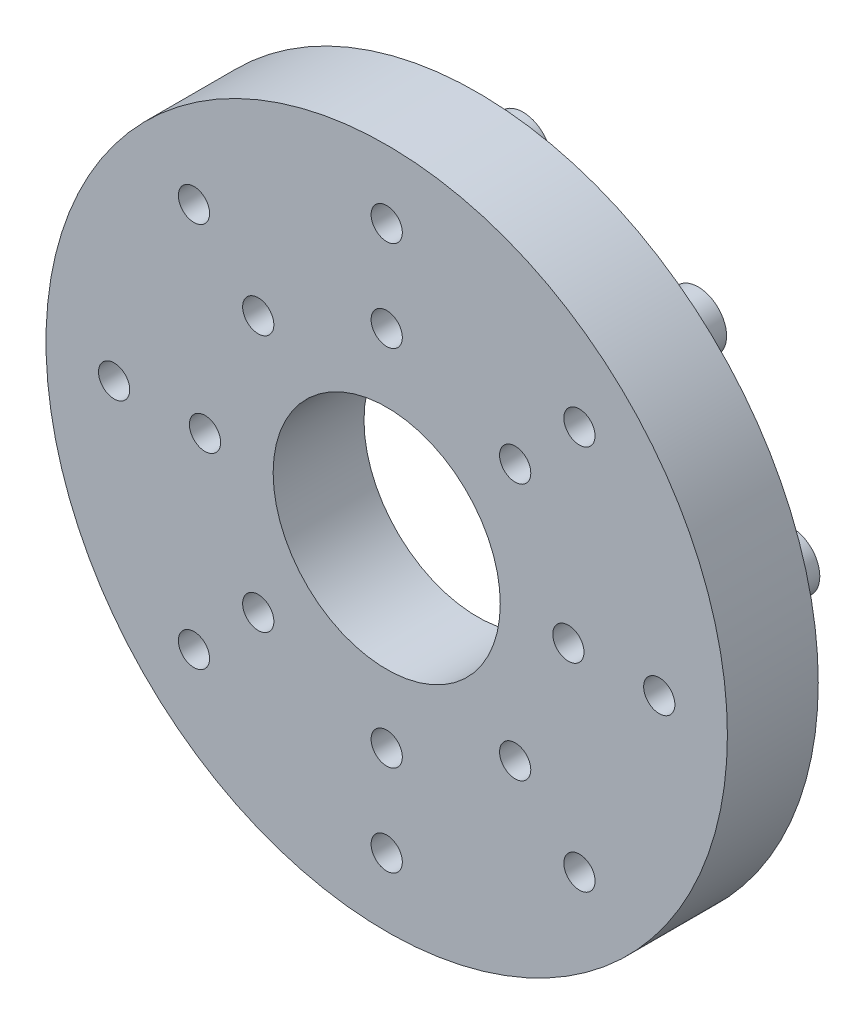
ISO-10303-21;
HEADER;
FILE_DESCRIPTION(('STEP AP214'),'2;1');
FILE_NAME('part.step','',(''),(''),'','','');
FILE_SCHEMA(('AUTOMOTIVE_DESIGN { 1 0 10303 214 1 1 1 1 }'));
ENDSEC;
DATA;
#1=APPLICATION_CONTEXT('core data for automotive mechanical design processes');
#2=APPLICATION_PROTOCOL_DEFINITION('international standard','automotive_design',2000,#1);
#3=PRODUCT_CONTEXT('',#1,'mechanical');
#4=PRODUCT('Part','Part','',(#3));
#5=PRODUCT_RELATED_PRODUCT_CATEGORY('part','',(#4));
#6=PRODUCT_DEFINITION_FORMATION('','',#4);
#7=PRODUCT_DEFINITION_CONTEXT('part definition',#1,'design');
#8=PRODUCT_DEFINITION('design','',#6,#7);
#9=PRODUCT_DEFINITION_SHAPE('','',#8);
#10=(LENGTH_UNIT() NAMED_UNIT(*) SI_UNIT(.MILLI.,.METRE.));
#11=(NAMED_UNIT(*) PLANE_ANGLE_UNIT() SI_UNIT($,.RADIAN.));
#12=(NAMED_UNIT(*) SI_UNIT($,.STERADIAN.) SOLID_ANGLE_UNIT());
#13=UNCERTAINTY_MEASURE_WITH_UNIT(LENGTH_MEASURE(1.E-05),#10,'distance_accuracy_value','');
#14=(GEOMETRIC_REPRESENTATION_CONTEXT(3) GLOBAL_UNCERTAINTY_ASSIGNED_CONTEXT((#13)) GLOBAL_UNIT_ASSIGNED_CONTEXT((#10,
#11,#12)) REPRESENTATION_CONTEXT('',''));
#15=CARTESIAN_POINT('',(0.,0.,0.));
#16=DIRECTION('',(0.,0.,1.));
#17=DIRECTION('',(1.,0.,0.));
#18=AXIS2_PLACEMENT_3D('',#15,#16,#17);
#19=CARTESIAN_POINT('',(0.,0.,-25.4));
#20=DIRECTION('',(0.,0.,1.));
#21=DIRECTION('',(1.,0.,0.));
#22=AXIS2_PLACEMENT_3D('',#19,#20,#21);
#23=PLANE('',#22);
#24=CARTESIAN_POINT('',(150.084701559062,26.4639822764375,-25.4));
#25=DIRECTION('',(0.,0.,1.));
#26=DIRECTION('',(1.,0.,0.));
#27=AXIS2_PLACEMENT_3D('',#24,#25,#26);
#28=CIRCLE('',#27,15.875);
#29=CARTESIAN_POINT('',(165.959701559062,26.4639822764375,-25.4));
#30=VERTEX_POINT('',#29);
#31=EDGE_CURVE('E56',#30,#30,#28,.F.);
#32=ORIENTED_EDGE('',*,*,#31,.F.);
#33=EDGE_LOOP('',(#32));
#34=FACE_BOUND('',#33,.T.);
#35=CARTESIAN_POINT('',(52.1238698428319,-143.209155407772,-25.4));
#36=DIRECTION('',(0.,0.,1.));
#37=DIRECTION('',(1.,0.,0.));
#38=AXIS2_PLACEMENT_3D('',#35,#36,#37);
#39=CIRCLE('',#38,15.875);
#40=CARTESIAN_POINT('',(67.9988698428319,-143.209155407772,-25.4));
#41=VERTEX_POINT('',#40);
#42=EDGE_CURVE('E264',#41,#41,#39,.F.);
#43=ORIENTED_EDGE('',*,*,#42,.F.);
#44=EDGE_LOOP('',(#43));
#45=FACE_BOUND('',#44,.T.);
#46=CARTESIAN_POINT('',(-131.982271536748,-76.2,-25.4));
#47=DIRECTION('',(0.,0.,1.));
#48=DIRECTION('',(1.,0.,0.));
#49=AXIS2_PLACEMENT_3D('',#46,#47,#48);
#50=CIRCLE('',#49,15.875);
#51=CARTESIAN_POINT('',(-116.107271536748,-76.2,-25.4));
#52=VERTEX_POINT('',#51);
#53=EDGE_CURVE('E258',#52,#52,#50,.F.);
#54=ORIENTED_EDGE('',*,*,#53,.F.);
#55=EDGE_LOOP('',(#54));
#56=FACE_BOUND('',#55,.T.);
#57=CARTESIAN_POINT('',(-97.9608317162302,116.745173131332,-25.4));
#58=DIRECTION('',(0.,0.,1.));
#59=DIRECTION('',(1.,0.,0.));
#60=AXIS2_PLACEMENT_3D('',#57,#58,#59);
#61=CIRCLE('',#60,15.875);
#62=CARTESIAN_POINT('',(-82.0858317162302,116.745173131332,-25.4));
#63=VERTEX_POINT('',#62);
#64=EDGE_CURVE('E252',#63,#63,#61,.F.);
#65=ORIENTED_EDGE('',*,*,#64,.F.);
#66=EDGE_LOOP('',(#65));
#67=FACE_BOUND('',#66,.T.);
#68=CARTESIAN_POINT('',(0.,0.,-25.4));
#69=DIRECTION('',(0.,0.,1.));
#70=DIRECTION('',(1.,0.,0.));
#71=AXIS2_PLACEMENT_3D('',#68,#69,#70);
#72=CIRCLE('',#71,63.5);
#73=CARTESIAN_POINT('',(63.5,0.,-25.4));
#74=VERTEX_POINT('',#73);
#75=EDGE_CURVE('E237',#74,#74,#72,.T.);
#76=ORIENTED_EDGE('',*,*,#75,.T.);
#77=EDGE_LOOP('',(#76));
#78=FACE_BOUND('',#77,.T.);
#79=CARTESIAN_POINT('',(0.,0.,-25.4));
#80=DIRECTION('',(0.,0.,1.));
#81=DIRECTION('',(1.,0.,0.));
#82=AXIS2_PLACEMENT_3D('',#79,#80,#81);
#83=CIRCLE('',#82,190.5);
#84=CARTESIAN_POINT('',(190.5,0.,-25.4));
#85=VERTEX_POINT('',#84);
#86=EDGE_CURVE('E241',#85,#85,#83,.T.);
#87=ORIENTED_EDGE('',*,*,#86,.F.);
#88=EDGE_LOOP('',(#87));
#89=FACE_BOUND('',#88,.T.);
#90=CARTESIAN_POINT('',(0.,152.4,-25.4));
#91=DIRECTION('',(0.,0.,1.));
#92=DIRECTION('',(1.,0.,0.));
#93=AXIS2_PLACEMENT_3D('',#90,#91,#92);
#94=CIRCLE('',#93,15.875);
#95=CARTESIAN_POINT('',(15.875,152.4,-25.4));
#96=VERTEX_POINT('',#95);
#97=EDGE_CURVE('E247',#96,#96,#94,.F.);
#98=ORIENTED_EDGE('',*,*,#97,.F.);
#99=EDGE_LOOP('',(#98));
#100=FACE_BOUND('',#99,.T.);
#101=CARTESIAN_POINT('',(-150.084701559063,26.4639822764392,-25.4));
#102=DIRECTION('',(0.,0.,1.));
#103=DIRECTION('',(1.,0.,0.));
#104=AXIS2_PLACEMENT_3D('',#101,#102,#103);
#105=CIRCLE('',#104,15.875);
#106=CARTESIAN_POINT('',(-134.209701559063,26.4639822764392,-25.4));
#107=VERTEX_POINT('',#106);
#108=EDGE_CURVE('E255',#107,#107,#105,.F.);
#109=ORIENTED_EDGE('',*,*,#108,.F.);
#110=EDGE_LOOP('',(#109));
#111=FACE_BOUND('',#110,.T.);
#112=CARTESIAN_POINT('',(-52.1238698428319,-143.209155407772,-25.4));
#113=DIRECTION('',(0.,0.,1.));
#114=DIRECTION('',(1.,0.,0.));
#115=AXIS2_PLACEMENT_3D('',#112,#113,#114);
#116=CIRCLE('',#115,15.875);
#117=CARTESIAN_POINT('',(-36.2488698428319,-143.209155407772,-25.4));
#118=VERTEX_POINT('',#117);
#119=EDGE_CURVE('E261',#118,#118,#116,.F.);
#120=ORIENTED_EDGE('',*,*,#119,.F.);
#121=EDGE_LOOP('',(#120));
#122=FACE_BOUND('',#121,.T.);
#123=CARTESIAN_POINT('',(131.982271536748,-76.2,-25.4));
#124=DIRECTION('',(0.,0.,1.));
#125=DIRECTION('',(1.,0.,0.));
#126=AXIS2_PLACEMENT_3D('',#123,#124,#125);
#127=CIRCLE('',#126,15.875);
#128=CARTESIAN_POINT('',(147.857271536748,-76.2,-25.4));
#129=VERTEX_POINT('',#128);
#130=EDGE_CURVE('E267',#129,#129,#127,.F.);
#131=ORIENTED_EDGE('',*,*,#130,.F.);
#132=EDGE_LOOP('',(#131));
#133=FACE_BOUND('',#132,.T.);
#134=CARTESIAN_POINT('',(97.9608317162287,116.745173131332,-25.4));
#135=DIRECTION('',(0.,0.,1.));
#136=DIRECTION('',(1.,0.,0.));
#137=AXIS2_PLACEMENT_3D('',#134,#135,#136);
#138=CIRCLE('',#137,15.875);
#139=CARTESIAN_POINT('',(113.835831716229,116.745173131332,-25.4));
#140=VERTEX_POINT('',#139);
#141=EDGE_CURVE('E13',#140,#140,#138,.F.);
#142=ORIENTED_EDGE('',*,*,#141,.F.);
#143=EDGE_LOOP('',(#142));
#144=FACE_BOUND('',#143,.T.);
#145=ADVANCED_FACE('F48',(#34,#45,#56,#67,#78,#89,#100,#111,#122,#133,#144),#23,.F.);
#146=CARTESIAN_POINT('',(0.,0.,25.4));
#147=DIRECTION('',(0.,0.,1.));
#148=DIRECTION('',(1.,0.,0.));
#149=AXIS2_PLACEMENT_3D('',#146,#147,#148);
#150=PLANE('',#149);
#151=CARTESIAN_POINT('',(0.,101.5873,25.4));
#152=DIRECTION('',(0.,0.,1.));
#153=DIRECTION('',(1.,0.,0.));
#154=AXIS2_PLACEMENT_3D('',#151,#152,#153);
#155=CIRCLE('',#154,8.73124999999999);
#156=CARTESIAN_POINT('',(8.73124999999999,101.5873,25.4));
#157=VERTEX_POINT('',#156);
#158=EDGE_CURVE('E116',#157,#157,#155,.T.);
#159=ORIENTED_EDGE('',*,*,#158,.F.);
#160=EDGE_LOOP('',(#159));
#161=FACE_BOUND('',#160,.T.);
#162=CARTESIAN_POINT('',(0.,152.4,25.4));
#163=DIRECTION('',(0.,0.,1.));
#164=DIRECTION('',(1.,0.,0.));
#165=AXIS2_PLACEMENT_3D('',#162,#163,#164);
#166=CIRCLE('',#165,8.73124999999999);
#167=CARTESIAN_POINT('',(8.73124999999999,152.4,25.4));
#168=VERTEX_POINT('',#167);
#169=EDGE_CURVE('E115',#168,#168,#166,.T.);
#170=ORIENTED_EDGE('',*,*,#169,.F.);
#171=EDGE_LOOP('',(#170));
#172=FACE_BOUND('',#171,.T.);
#173=CARTESIAN_POINT('',(107.763073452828,107.763073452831,25.4));
#174=DIRECTION('',(0.,0.,1.));
#175=DIRECTION('',(1.,0.,0.));
#176=AXIS2_PLACEMENT_3D('',#173,#174,#175);
#177=CIRCLE('',#176,8.73125);
#178=CARTESIAN_POINT('',(116.494323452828,107.763073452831,25.4));
#179=VERTEX_POINT('',#178);
#180=EDGE_CURVE('E126',#179,#179,#177,.T.);
#181=ORIENTED_EDGE('',*,*,#180,.F.);
#182=EDGE_LOOP('',(#181));
#183=FACE_BOUND('',#182,.T.);
#184=CARTESIAN_POINT('',(71.8330687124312,71.8330687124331,25.4));
#185=DIRECTION('',(0.,0.,1.));
#186=DIRECTION('',(1.,0.,0.));
#187=AXIS2_PLACEMENT_3D('',#184,#185,#186);
#188=CIRCLE('',#187,8.73125);
#189=CARTESIAN_POINT('',(80.5643187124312,71.8330687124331,25.4));
#190=VERTEX_POINT('',#189);
#191=EDGE_CURVE('E132',#190,#190,#188,.T.);
#192=ORIENTED_EDGE('',*,*,#191,.F.);
#193=EDGE_LOOP('',(#192));
#194=FACE_BOUND('',#193,.T.);
#195=CARTESIAN_POINT('',(101.5873,0.,25.4));
#196=DIRECTION('',(0.,0.,1.));
#197=DIRECTION('',(1.,0.,0.));
#198=AXIS2_PLACEMENT_3D('',#195,#196,#197);
#199=CIRCLE('',#198,8.73125);
#200=CARTESIAN_POINT('',(110.31855,0.,25.4));
#201=VERTEX_POINT('',#200);
#202=EDGE_CURVE('E138',#201,#201,#199,.T.);
#203=ORIENTED_EDGE('',*,*,#202,.F.);
#204=EDGE_LOOP('',(#203));
#205=FACE_BOUND('',#204,.T.);
#206=CARTESIAN_POINT('',(152.4,0.,25.4));
#207=DIRECTION('',(0.,0.,1.));
#208=DIRECTION('',(1.,0.,0.));
#209=AXIS2_PLACEMENT_3D('',#206,#207,#208);
#210=CIRCLE('',#209,8.73125);
#211=CARTESIAN_POINT('',(161.13125,0.,25.4));
#212=VERTEX_POINT('',#211);
#213=EDGE_CURVE('E144',#212,#212,#210,.T.);
#214=ORIENTED_EDGE('',*,*,#213,.F.);
#215=EDGE_LOOP('',(#214));
#216=FACE_BOUND('',#215,.T.);
#217=CARTESIAN_POINT('',(71.8330687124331,-71.8330687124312,25.4));
#218=DIRECTION('',(0.,0.,1.));
#219=DIRECTION('',(1.,0.,0.));
#220=AXIS2_PLACEMENT_3D('',#217,#218,#219);
#221=CIRCLE('',#220,8.73125);
#222=CARTESIAN_POINT('',(80.5643187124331,-71.8330687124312,25.4));
#223=VERTEX_POINT('',#222);
#224=EDGE_CURVE('E150',#223,#223,#221,.T.);
#225=ORIENTED_EDGE('',*,*,#224,.F.);
#226=EDGE_LOOP('',(#225));
#227=FACE_BOUND('',#226,.T.);
#228=CARTESIAN_POINT('',(107.763073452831,-107.763073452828,25.4));
#229=DIRECTION('',(0.,0.,1.));
#230=DIRECTION('',(1.,0.,0.));
#231=AXIS2_PLACEMENT_3D('',#228,#229,#230);
#232=CIRCLE('',#231,8.73125);
#233=CARTESIAN_POINT('',(116.494323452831,-107.763073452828,25.4));
#234=VERTEX_POINT('',#233);
#235=EDGE_CURVE('E156',#234,#234,#232,.T.);
#236=ORIENTED_EDGE('',*,*,#235,.F.);
#237=EDGE_LOOP('',(#236));
#238=FACE_BOUND('',#237,.T.);
#239=CARTESIAN_POINT('',(0.,-101.5873,25.4));
#240=DIRECTION('',(0.,0.,1.));
#241=DIRECTION('',(1.,0.,0.));
#242=AXIS2_PLACEMENT_3D('',#239,#240,#241);
#243=CIRCLE('',#242,8.73124999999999);
#244=CARTESIAN_POINT('',(8.73124999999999,-101.5873,25.4));
#245=VERTEX_POINT('',#244);
#246=EDGE_CURVE('E162',#245,#245,#243,.T.);
#247=ORIENTED_EDGE('',*,*,#246,.F.);
#248=EDGE_LOOP('',(#247));
#249=FACE_BOUND('',#248,.T.);
#250=CARTESIAN_POINT('',(0.,-152.4,25.4));
#251=DIRECTION('',(0.,0.,1.));
#252=DIRECTION('',(1.,0.,0.));
#253=AXIS2_PLACEMENT_3D('',#250,#251,#252);
#254=CIRCLE('',#253,8.73124999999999);
#255=CARTESIAN_POINT('',(8.73124999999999,-152.4,25.4));
#256=VERTEX_POINT('',#255);
#257=EDGE_CURVE('E168',#256,#256,#254,.T.);
#258=ORIENTED_EDGE('',*,*,#257,.F.);
#259=EDGE_LOOP('',(#258));
#260=FACE_BOUND('',#259,.T.);
#261=CARTESIAN_POINT('',(-107.763073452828,-107.763073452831,25.4));
#262=DIRECTION('',(0.,0.,1.));
#263=DIRECTION('',(1.,0.,0.));
#264=AXIS2_PLACEMENT_3D('',#261,#262,#263);
#265=CIRCLE('',#264,8.73125);
#266=CARTESIAN_POINT('',(-99.0318234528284,-107.763073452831,25.4));
#267=VERTEX_POINT('',#266);
#268=EDGE_CURVE('E174',#267,#267,#265,.T.);
#269=ORIENTED_EDGE('',*,*,#268,.F.);
#270=EDGE_LOOP('',(#269));
#271=FACE_BOUND('',#270,.T.);
#272=CARTESIAN_POINT('',(-71.8330687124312,-71.8330687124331,25.4));
#273=DIRECTION('',(0.,0.,1.));
#274=DIRECTION('',(1.,0.,0.));
#275=AXIS2_PLACEMENT_3D('',#272,#273,#274);
#276=CIRCLE('',#275,8.73125);
#277=CARTESIAN_POINT('',(-63.1018187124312,-71.8330687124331,25.4));
#278=VERTEX_POINT('',#277);
#279=EDGE_CURVE('E180',#278,#278,#276,.T.);
#280=ORIENTED_EDGE('',*,*,#279,.F.);
#281=EDGE_LOOP('',(#280));
#282=FACE_BOUND('',#281,.T.);
#283=CARTESIAN_POINT('',(-152.4,0.,25.4));
#284=DIRECTION('',(0.,0.,1.));
#285=DIRECTION('',(1.,0.,0.));
#286=AXIS2_PLACEMENT_3D('',#283,#284,#285);
#287=CIRCLE('',#286,8.73125);
#288=CARTESIAN_POINT('',(-143.66875,0.,25.4));
#289=VERTEX_POINT('',#288);
#290=EDGE_CURVE('E186',#289,#289,#287,.T.);
#291=ORIENTED_EDGE('',*,*,#290,.F.);
#292=EDGE_LOOP('',(#291));
#293=FACE_BOUND('',#292,.T.);
#294=CARTESIAN_POINT('',(-101.5873,0.,25.4));
#295=DIRECTION('',(0.,0.,1.));
#296=DIRECTION('',(1.,0.,0.));
#297=AXIS2_PLACEMENT_3D('',#294,#295,#296);
#298=CIRCLE('',#297,8.73125);
#299=CARTESIAN_POINT('',(-92.85605,0.,25.4));
#300=VERTEX_POINT('',#299);
#301=EDGE_CURVE('E192',#300,#300,#298,.T.);
#302=ORIENTED_EDGE('',*,*,#301,.F.);
#303=EDGE_LOOP('',(#302));
#304=FACE_BOUND('',#303,.T.);
#305=CARTESIAN_POINT('',(-71.8330687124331,71.8330687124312,25.4));
#306=DIRECTION('',(0.,0.,1.));
#307=DIRECTION('',(1.,0.,0.));
#308=AXIS2_PLACEMENT_3D('',#305,#306,#307);
#309=CIRCLE('',#308,8.73125);
#310=CARTESIAN_POINT('',(-63.1018187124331,71.8330687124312,25.4));
#311=VERTEX_POINT('',#310);
#312=EDGE_CURVE('E198',#311,#311,#309,.T.);
#313=ORIENTED_EDGE('',*,*,#312,.F.);
#314=EDGE_LOOP('',(#313));
#315=FACE_BOUND('',#314,.T.);
#316=CARTESIAN_POINT('',(-107.763073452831,107.763073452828,25.4));
#317=DIRECTION('',(0.,0.,1.));
#318=DIRECTION('',(1.,0.,0.));
#319=AXIS2_PLACEMENT_3D('',#316,#317,#318);
#320=CIRCLE('',#319,8.73125);
#321=CARTESIAN_POINT('',(-99.0318234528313,107.763073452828,25.4));
#322=VERTEX_POINT('',#321);
#323=EDGE_CURVE('E204',#322,#322,#320,.T.);
#324=ORIENTED_EDGE('',*,*,#323,.F.);
#325=EDGE_LOOP('',(#324));
#326=FACE_BOUND('',#325,.T.);
#327=CARTESIAN_POINT('',(0.,0.,25.4));
#328=DIRECTION('',(0.,0.,1.));
#329=DIRECTION('',(1.,0.,0.));
#330=AXIS2_PLACEMENT_3D('',#327,#328,#329);
#331=CIRCLE('',#330,190.5);
#332=CARTESIAN_POINT('',(190.5,0.,25.4));
#333=VERTEX_POINT('',#332);
#334=EDGE_CURVE('E244',#333,#333,#331,.T.);
#335=ORIENTED_EDGE('',*,*,#334,.T.);
#336=EDGE_LOOP('',(#335));
#337=FACE_BOUND('',#336,.T.);
#338=CARTESIAN_POINT('',(0.,0.,25.4));
#339=DIRECTION('',(0.,0.,1.));
#340=DIRECTION('',(1.,0.,0.));
#341=AXIS2_PLACEMENT_3D('',#338,#339,#340);
#342=CIRCLE('',#341,63.5);
#343=CARTESIAN_POINT('',(63.5,0.,25.4));
#344=VERTEX_POINT('',#343);
#345=EDGE_CURVE('E238',#344,#344,#342,.T.);
#346=ORIENTED_EDGE('',*,*,#345,.F.);
#347=EDGE_LOOP('',(#346));
#348=FACE_BOUND('',#347,.T.);
#349=ADVANCED_FACE('F276',(#161,#172,#183,#194,#205,#216,#227,#238,#249,#260,#271,#282,#293,
#304,#315,#326,#337,#348),#150,.T.);
#350=CARTESIAN_POINT('',(0.,0.,25.4));
#351=DIRECTION('',(0.,0.,-1.));
#352=DIRECTION('',(-1.,0.,0.));
#353=AXIS2_PLACEMENT_3D('',#350,#351,#352);
#354=CYLINDRICAL_SURFACE('',#353,190.5);
#355=ORIENTED_EDGE('',*,*,#334,.F.);
#356=EDGE_LOOP('',(#355));
#357=FACE_BOUND('',#356,.T.);
#358=ORIENTED_EDGE('',*,*,#86,.T.);
#359=EDGE_LOOP('',(#358));
#360=FACE_BOUND('',#359,.T.);
#361=ADVANCED_FACE('F50',(#357,#360),#354,.T.);
#362=CARTESIAN_POINT('',(0.,0.,25.4));
#363=DIRECTION('',(0.,0.,-1.));
#364=DIRECTION('',(-1.,0.,0.));
#365=AXIS2_PLACEMENT_3D('',#362,#363,#364);
#366=CYLINDRICAL_SURFACE('',#365,63.5);
#367=ORIENTED_EDGE('',*,*,#345,.T.);
#368=EDGE_LOOP('',(#367));
#369=FACE_BOUND('',#368,.T.);
#370=ORIENTED_EDGE('',*,*,#75,.F.);
#371=EDGE_LOOP('',(#370));
#372=FACE_BOUND('',#371,.T.);
#373=ADVANCED_FACE('F373',(#369,#372),#366,.F.);
#374=CARTESIAN_POINT('',(0.,152.4,-50.8));
#375=DIRECTION('',(0.,0.,1.));
#376=DIRECTION('',(1.,0.,0.));
#377=AXIS2_PLACEMENT_3D('',#374,#375,#376);
#378=CYLINDRICAL_SURFACE('',#377,15.875);
#379=CARTESIAN_POINT('',(0.,152.4,-50.8));
#380=DIRECTION('',(0.,0.,-1.));
#381=DIRECTION('',(-1.,0.,0.));
#382=AXIS2_PLACEMENT_3D('',#379,#380,#381);
#383=CIRCLE('',#382,15.875);
#384=CARTESIAN_POINT('',(-15.875,152.4,-50.8));
#385=VERTEX_POINT('',#384);
#386=EDGE_CURVE('E234',#385,#385,#383,.T.);
#387=ORIENTED_EDGE('',*,*,#386,.F.);
#388=EDGE_LOOP('',(#387));
#389=FACE_BOUND('',#388,.T.);
#390=ORIENTED_EDGE('',*,*,#97,.T.);
#391=EDGE_LOOP('',(#390));
#392=FACE_BOUND('',#391,.T.);
#393=ADVANCED_FACE('F369',(#389,#392),#378,.T.);
#394=CARTESIAN_POINT('',(0.,152.4,-50.8));
#395=DIRECTION('',(0.,0.,-1.));
#396=DIRECTION('',(-1.,0.,0.));
#397=AXIS2_PLACEMENT_3D('',#394,#395,#396);
#398=PLANE('',#397);
#399=ORIENTED_EDGE('',*,*,#386,.T.);
#400=EDGE_LOOP('',(#399));
#401=FACE_BOUND('',#400,.T.);
#402=ADVANCED_FACE('F365',(#401),#398,.T.);
#403=CARTESIAN_POINT('',(-97.9608317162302,116.745173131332,-50.8));
#404=DIRECTION('',(0.,0.,1.));
#405=DIRECTION('',(1.,0.,0.));
#406=AXIS2_PLACEMENT_3D('',#403,#404,#405);
#407=CYLINDRICAL_SURFACE('',#406,15.875);
#408=CARTESIAN_POINT('',(-97.9608317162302,116.745173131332,-50.8));
#409=DIRECTION('',(0.,0.,-1.));
#410=DIRECTION('',(-1.,0.,0.));
#411=AXIS2_PLACEMENT_3D('',#408,#409,#410);
#412=CIRCLE('',#411,15.875);
#413=CARTESIAN_POINT('',(-113.83583171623,116.745173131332,-50.8));
#414=VERTEX_POINT('',#413);
#415=EDGE_CURVE('E231',#414,#414,#412,.T.);
#416=ORIENTED_EDGE('',*,*,#415,.F.);
#417=EDGE_LOOP('',(#416));
#418=FACE_BOUND('',#417,.T.);
#419=ORIENTED_EDGE('',*,*,#64,.T.);
#420=EDGE_LOOP('',(#419));
#421=FACE_BOUND('',#420,.T.);
#422=ADVANCED_FACE('F361',(#418,#421),#407,.T.);
#423=CARTESIAN_POINT('',(-97.9608317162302,116.745173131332,-50.8));
#424=DIRECTION('',(0.,0.,-1.));
#425=DIRECTION('',(-1.,0.,0.));
#426=AXIS2_PLACEMENT_3D('',#423,#424,#425);
#427=PLANE('',#426);
#428=ORIENTED_EDGE('',*,*,#415,.T.);
#429=EDGE_LOOP('',(#428));
#430=FACE_BOUND('',#429,.T.);
#431=ADVANCED_FACE('F357',(#430),#427,.T.);
#432=CARTESIAN_POINT('',(-150.084701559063,26.4639822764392,-50.8));
#433=DIRECTION('',(0.,0.,1.));
#434=DIRECTION('',(1.,0.,0.));
#435=AXIS2_PLACEMENT_3D('',#432,#433,#434);
#436=CYLINDRICAL_SURFACE('',#435,15.875);
#437=CARTESIAN_POINT('',(-150.084701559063,26.4639822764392,-50.8));
#438=DIRECTION('',(0.,0.,-1.));
#439=DIRECTION('',(-1.,0.,0.));
#440=AXIS2_PLACEMENT_3D('',#437,#438,#439);
#441=CIRCLE('',#440,15.875);
#442=CARTESIAN_POINT('',(-165.959701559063,26.4639822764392,-50.8));
#443=VERTEX_POINT('',#442);
#444=EDGE_CURVE('E228',#443,#443,#441,.T.);
#445=ORIENTED_EDGE('',*,*,#444,.F.);
#446=EDGE_LOOP('',(#445));
#447=FACE_BOUND('',#446,.T.);
#448=ORIENTED_EDGE('',*,*,#108,.T.);
#449=EDGE_LOOP('',(#448));
#450=FACE_BOUND('',#449,.T.);
#451=ADVANCED_FACE('F353',(#447,#450),#436,.T.);
#452=CARTESIAN_POINT('',(-150.084701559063,26.4639822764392,-50.8));
#453=DIRECTION('',(0.,0.,-1.));
#454=DIRECTION('',(-1.,0.,0.));
#455=AXIS2_PLACEMENT_3D('',#452,#453,#454);
#456=PLANE('',#455);
#457=ORIENTED_EDGE('',*,*,#444,.T.);
#458=EDGE_LOOP('',(#457));
#459=FACE_BOUND('',#458,.T.);
#460=ADVANCED_FACE('F349',(#459),#456,.T.);
#461=CARTESIAN_POINT('',(-131.982271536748,-76.2,-50.8));
#462=DIRECTION('',(0.,0.,1.));
#463=DIRECTION('',(1.,0.,0.));
#464=AXIS2_PLACEMENT_3D('',#461,#462,#463);
#465=CYLINDRICAL_SURFACE('',#464,15.875);
#466=CARTESIAN_POINT('',(-131.982271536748,-76.2,-50.8));
#467=DIRECTION('',(0.,0.,-1.));
#468=DIRECTION('',(-1.,0.,0.));
#469=AXIS2_PLACEMENT_3D('',#466,#467,#468);
#470=CIRCLE('',#469,15.875);
#471=CARTESIAN_POINT('',(-147.857271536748,-76.2,-50.8));
#472=VERTEX_POINT('',#471);
#473=EDGE_CURVE('E225',#472,#472,#470,.T.);
#474=ORIENTED_EDGE('',*,*,#473,.F.);
#475=EDGE_LOOP('',(#474));
#476=FACE_BOUND('',#475,.T.);
#477=ORIENTED_EDGE('',*,*,#53,.T.);
#478=EDGE_LOOP('',(#477));
#479=FACE_BOUND('',#478,.T.);
#480=ADVANCED_FACE('F345',(#476,#479),#465,.T.);
#481=CARTESIAN_POINT('',(-131.982271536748,-76.2,-50.8));
#482=DIRECTION('',(0.,0.,-1.));
#483=DIRECTION('',(-1.,0.,0.));
#484=AXIS2_PLACEMENT_3D('',#481,#482,#483);
#485=PLANE('',#484);
#486=ORIENTED_EDGE('',*,*,#473,.T.);
#487=EDGE_LOOP('',(#486));
#488=FACE_BOUND('',#487,.T.);
#489=ADVANCED_FACE('F341',(#488),#485,.T.);
#490=CARTESIAN_POINT('',(-52.1238698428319,-143.209155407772,-50.8));
#491=DIRECTION('',(0.,0.,1.));
#492=DIRECTION('',(1.,0.,0.));
#493=AXIS2_PLACEMENT_3D('',#490,#491,#492);
#494=CYLINDRICAL_SURFACE('',#493,15.875);
#495=CARTESIAN_POINT('',(-52.1238698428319,-143.209155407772,-50.8));
#496=DIRECTION('',(0.,0.,-1.));
#497=DIRECTION('',(-1.,0.,0.));
#498=AXIS2_PLACEMENT_3D('',#495,#496,#497);
#499=CIRCLE('',#498,15.875);
#500=CARTESIAN_POINT('',(-67.9988698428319,-143.209155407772,-50.8));
#501=VERTEX_POINT('',#500);
#502=EDGE_CURVE('E222',#501,#501,#499,.T.);
#503=ORIENTED_EDGE('',*,*,#502,.F.);
#504=EDGE_LOOP('',(#503));
#505=FACE_BOUND('',#504,.T.);
#506=ORIENTED_EDGE('',*,*,#119,.T.);
#507=EDGE_LOOP('',(#506));
#508=FACE_BOUND('',#507,.T.);
#509=ADVANCED_FACE('F337',(#505,#508),#494,.T.);
#510=CARTESIAN_POINT('',(-52.1238698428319,-143.209155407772,-50.8));
#511=DIRECTION('',(0.,0.,-1.));
#512=DIRECTION('',(-1.,0.,0.));
#513=AXIS2_PLACEMENT_3D('',#510,#511,#512);
#514=PLANE('',#513);
#515=ORIENTED_EDGE('',*,*,#502,.T.);
#516=EDGE_LOOP('',(#515));
#517=FACE_BOUND('',#516,.T.);
#518=ADVANCED_FACE('F333',(#517),#514,.T.);
#519=CARTESIAN_POINT('',(52.1238698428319,-143.209155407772,-50.8));
#520=DIRECTION('',(0.,0.,1.));
#521=DIRECTION('',(1.,0.,0.));
#522=AXIS2_PLACEMENT_3D('',#519,#520,#521);
#523=CYLINDRICAL_SURFACE('',#522,15.875);
#524=CARTESIAN_POINT('',(52.1238698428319,-143.209155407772,-50.8));
#525=DIRECTION('',(0.,0.,-1.));
#526=DIRECTION('',(-1.,0.,0.));
#527=AXIS2_PLACEMENT_3D('',#524,#525,#526);
#528=CIRCLE('',#527,15.875);
#529=CARTESIAN_POINT('',(36.2488698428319,-143.209155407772,-50.8));
#530=VERTEX_POINT('',#529);
#531=EDGE_CURVE('E219',#530,#530,#528,.T.);
#532=ORIENTED_EDGE('',*,*,#531,.F.);
#533=EDGE_LOOP('',(#532));
#534=FACE_BOUND('',#533,.T.);
#535=ORIENTED_EDGE('',*,*,#42,.T.);
#536=EDGE_LOOP('',(#535));
#537=FACE_BOUND('',#536,.T.);
#538=ADVANCED_FACE('F329',(#534,#537),#523,.T.);
#539=CARTESIAN_POINT('',(52.1238698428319,-143.209155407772,-50.8));
#540=DIRECTION('',(0.,0.,-1.));
#541=DIRECTION('',(-1.,0.,0.));
#542=AXIS2_PLACEMENT_3D('',#539,#540,#541);
#543=PLANE('',#542);
#544=ORIENTED_EDGE('',*,*,#531,.T.);
#545=EDGE_LOOP('',(#544));
#546=FACE_BOUND('',#545,.T.);
#547=ADVANCED_FACE('F325',(#546),#543,.T.);
#548=CARTESIAN_POINT('',(131.982271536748,-76.2,-50.8));
#549=DIRECTION('',(0.,0.,1.));
#550=DIRECTION('',(1.,0.,0.));
#551=AXIS2_PLACEMENT_3D('',#548,#549,#550);
#552=CYLINDRICAL_SURFACE('',#551,15.875);
#553=CARTESIAN_POINT('',(131.982271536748,-76.2,-50.8));
#554=DIRECTION('',(0.,0.,-1.));
#555=DIRECTION('',(-1.,0.,0.));
#556=AXIS2_PLACEMENT_3D('',#553,#554,#555);
#557=CIRCLE('',#556,15.875);
#558=CARTESIAN_POINT('',(116.107271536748,-76.2,-50.8));
#559=VERTEX_POINT('',#558);
#560=EDGE_CURVE('E216',#559,#559,#557,.T.);
#561=ORIENTED_EDGE('',*,*,#560,.F.);
#562=EDGE_LOOP('',(#561));
#563=FACE_BOUND('',#562,.T.);
#564=ORIENTED_EDGE('',*,*,#130,.T.);
#565=EDGE_LOOP('',(#564));
#566=FACE_BOUND('',#565,.T.);
#567=ADVANCED_FACE('F321',(#563,#566),#552,.T.);
#568=CARTESIAN_POINT('',(131.982271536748,-76.2,-50.8));
#569=DIRECTION('',(0.,0.,-1.));
#570=DIRECTION('',(-1.,0.,0.));
#571=AXIS2_PLACEMENT_3D('',#568,#569,#570);
#572=PLANE('',#571);
#573=ORIENTED_EDGE('',*,*,#560,.T.);
#574=EDGE_LOOP('',(#573));
#575=FACE_BOUND('',#574,.T.);
#576=ADVANCED_FACE('F317',(#575),#572,.T.);
#577=CARTESIAN_POINT('',(150.084701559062,26.4639822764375,-50.8));
#578=DIRECTION('',(0.,0.,1.));
#579=DIRECTION('',(1.,0.,0.));
#580=AXIS2_PLACEMENT_3D('',#577,#578,#579);
#581=CYLINDRICAL_SURFACE('',#580,15.875);
#582=CARTESIAN_POINT('',(150.084701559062,26.4639822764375,-50.8));
#583=DIRECTION('',(0.,0.,-1.));
#584=DIRECTION('',(-1.,0.,0.));
#585=AXIS2_PLACEMENT_3D('',#582,#583,#584);
#586=CIRCLE('',#585,15.875);
#587=CARTESIAN_POINT('',(134.209701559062,26.4639822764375,-50.8));
#588=VERTEX_POINT('',#587);
#589=EDGE_CURVE('E213',#588,#588,#586,.T.);
#590=ORIENTED_EDGE('',*,*,#589,.F.);
#591=EDGE_LOOP('',(#590));
#592=FACE_BOUND('',#591,.T.);
#593=ORIENTED_EDGE('',*,*,#31,.T.);
#594=EDGE_LOOP('',(#593));
#595=FACE_BOUND('',#594,.T.);
#596=ADVANCED_FACE('F272',(#592,#595),#581,.T.);
#597=CARTESIAN_POINT('',(150.084701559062,26.4639822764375,-50.8));
#598=DIRECTION('',(0.,0.,-1.));
#599=DIRECTION('',(-1.,0.,0.));
#600=AXIS2_PLACEMENT_3D('',#597,#598,#599);
#601=PLANE('',#600);
#602=ORIENTED_EDGE('',*,*,#589,.T.);
#603=EDGE_LOOP('',(#602));
#604=FACE_BOUND('',#603,.T.);
#605=ADVANCED_FACE('F300',(#604),#601,.T.);
#606=CARTESIAN_POINT('',(97.9608317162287,116.745173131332,-50.8));
#607=DIRECTION('',(0.,0.,1.));
#608=DIRECTION('',(1.,0.,0.));
#609=AXIS2_PLACEMENT_3D('',#606,#607,#608);
#610=CYLINDRICAL_SURFACE('',#609,15.875);
#611=CARTESIAN_POINT('',(97.9608317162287,116.745173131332,-50.8));
#612=DIRECTION('',(0.,0.,-1.));
#613=DIRECTION('',(-1.,0.,0.));
#614=AXIS2_PLACEMENT_3D('',#611,#612,#613);
#615=CIRCLE('',#614,15.875);
#616=CARTESIAN_POINT('',(82.0858317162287,116.745173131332,-50.8));
#617=VERTEX_POINT('',#616);
#618=EDGE_CURVE('E210',#617,#617,#615,.T.);
#619=ORIENTED_EDGE('',*,*,#618,.F.);
#620=EDGE_LOOP('',(#619));
#621=FACE_BOUND('',#620,.T.);
#622=ORIENTED_EDGE('',*,*,#141,.T.);
#623=EDGE_LOOP('',(#622));
#624=FACE_BOUND('',#623,.T.);
#625=ADVANCED_FACE('F297',(#621,#624),#610,.T.);
#626=CARTESIAN_POINT('',(97.9608317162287,116.745173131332,-50.8));
#627=DIRECTION('',(0.,0.,-1.));
#628=DIRECTION('',(-1.,0.,0.));
#629=AXIS2_PLACEMENT_3D('',#626,#627,#628);
#630=PLANE('',#629);
#631=ORIENTED_EDGE('',*,*,#618,.T.);
#632=EDGE_LOOP('',(#631));
#633=FACE_BOUND('',#632,.T.);
#634=ADVANCED_FACE('F299',(#633),#630,.T.);
#635=CARTESIAN_POINT('',(-107.763073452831,107.763073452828,-17.526));
#636=DIRECTION('',(0.,0.,1.));
#637=DIRECTION('',(1.,0.,0.));
#638=AXIS2_PLACEMENT_3D('',#635,#636,#637);
#639=CONICAL_SURFACE('',#638,8.73124999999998,1.02974425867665);
#640=CARTESIAN_POINT('',(-107.763073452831,107.763073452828,-22.7722642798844));
#641=VERTEX_POINT('',#640);
#642=VERTEX_LOOP('',#641);
#643=FACE_BOUND('',#642,.T.);
#644=CARTESIAN_POINT('',(-107.763073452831,107.763073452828,-17.526));
#645=DIRECTION('',(0.,0.,1.));
#646=DIRECTION('',(1.,0.,0.));
#647=AXIS2_PLACEMENT_3D('',#644,#645,#646);
#648=CIRCLE('',#647,8.73124999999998);
#649=CARTESIAN_POINT('',(-99.0318234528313,107.763073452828,-17.526));
#650=VERTEX_POINT('',#649);
#651=EDGE_CURVE('E207',#650,#650,#648,.T.);
#652=ORIENTED_EDGE('',*,*,#651,.T.);
#653=EDGE_LOOP('',(#652));
#654=FACE_BOUND('',#653,.T.);
#655=ADVANCED_FACE('F307',(#643,#654),#639,.F.);
#656=CARTESIAN_POINT('',(-107.763073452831,107.763073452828,25.4));
#657=DIRECTION('',(0.,0.,1.));
#658=DIRECTION('',(1.,0.,0.));
#659=AXIS2_PLACEMENT_3D('',#656,#657,#658);
#660=CYLINDRICAL_SURFACE('',#659,8.73124999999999);
#661=ORIENTED_EDGE('',*,*,#651,.F.);
#662=EDGE_LOOP('',(#661));
#663=FACE_BOUND('',#662,.T.);
#664=ORIENTED_EDGE('',*,*,#323,.T.);
#665=EDGE_LOOP('',(#664));
#666=FACE_BOUND('',#665,.T.);
#667=ADVANCED_FACE('F422',(#663,#666),#660,.F.);
#668=CARTESIAN_POINT('',(-71.8330687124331,71.8330687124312,-17.526));
#669=DIRECTION('',(0.,0.,1.));
#670=DIRECTION('',(1.,0.,0.));
#671=AXIS2_PLACEMENT_3D('',#668,#669,#670);
#672=CONICAL_SURFACE('',#671,8.73124999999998,1.02974425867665);
#673=CARTESIAN_POINT('',(-71.8330687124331,71.8330687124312,-22.7722642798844));
#674=VERTEX_POINT('',#673);
#675=VERTEX_LOOP('',#674);
#676=FACE_BOUND('',#675,.T.);
#677=CARTESIAN_POINT('',(-71.8330687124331,71.8330687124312,-17.526));
#678=DIRECTION('',(0.,0.,1.));
#679=DIRECTION('',(1.,0.,0.));
#680=AXIS2_PLACEMENT_3D('',#677,#678,#679);
#681=CIRCLE('',#680,8.73124999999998);
#682=CARTESIAN_POINT('',(-63.1018187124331,71.8330687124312,-17.526));
#683=VERTEX_POINT('',#682);
#684=EDGE_CURVE('E201',#683,#683,#681,.T.);
#685=ORIENTED_EDGE('',*,*,#684,.T.);
#686=EDGE_LOOP('',(#685));
#687=FACE_BOUND('',#686,.T.);
#688=ADVANCED_FACE('F424',(#676,#687),#672,.F.);
#689=CARTESIAN_POINT('',(-71.8330687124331,71.8330687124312,25.4));
#690=DIRECTION('',(0.,0.,1.));
#691=DIRECTION('',(1.,0.,0.));
#692=AXIS2_PLACEMENT_3D('',#689,#690,#691);
#693=CYLINDRICAL_SURFACE('',#692,8.73124999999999);
#694=ORIENTED_EDGE('',*,*,#684,.F.);
#695=EDGE_LOOP('',(#694));
#696=FACE_BOUND('',#695,.T.);
#697=ORIENTED_EDGE('',*,*,#312,.T.);
#698=EDGE_LOOP('',(#697));
#699=FACE_BOUND('',#698,.T.);
#700=ADVANCED_FACE('F431',(#696,#699),#693,.F.);
#701=CARTESIAN_POINT('',(-101.5873,0.,-17.526));
#702=DIRECTION('',(0.,0.,1.));
#703=DIRECTION('',(1.,0.,0.));
#704=AXIS2_PLACEMENT_3D('',#701,#702,#703);
#705=CONICAL_SURFACE('',#704,8.73124999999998,1.02974425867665);
#706=CARTESIAN_POINT('',(-101.5873,0.,-22.7722642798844));
#707=VERTEX_POINT('',#706);
#708=VERTEX_LOOP('',#707);
#709=FACE_BOUND('',#708,.T.);
#710=CARTESIAN_POINT('',(-101.5873,0.,-17.526));
#711=DIRECTION('',(0.,0.,1.));
#712=DIRECTION('',(1.,0.,0.));
#713=AXIS2_PLACEMENT_3D('',#710,#711,#712);
#714=CIRCLE('',#713,8.73124999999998);
#715=CARTESIAN_POINT('',(-92.85605,0.,-17.526));
#716=VERTEX_POINT('',#715);
#717=EDGE_CURVE('E195',#716,#716,#714,.T.);
#718=ORIENTED_EDGE('',*,*,#717,.T.);
#719=EDGE_LOOP('',(#718));
#720=FACE_BOUND('',#719,.T.);
#721=ADVANCED_FACE('F437',(#709,#720),#705,.F.);
#722=CARTESIAN_POINT('',(-101.5873,0.,25.4));
#723=DIRECTION('',(0.,0.,1.));
#724=DIRECTION('',(1.,0.,0.));
#725=AXIS2_PLACEMENT_3D('',#722,#723,#724);
#726=CYLINDRICAL_SURFACE('',#725,8.73124999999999);
#727=ORIENTED_EDGE('',*,*,#717,.F.);
#728=EDGE_LOOP('',(#727));
#729=FACE_BOUND('',#728,.T.);
#730=ORIENTED_EDGE('',*,*,#301,.T.);
#731=EDGE_LOOP('',(#730));
#732=FACE_BOUND('',#731,.T.);
#733=ADVANCED_FACE('F441',(#729,#732),#726,.F.);
#734=CARTESIAN_POINT('',(-152.4,0.,-17.526));
#735=DIRECTION('',(0.,0.,1.));
#736=DIRECTION('',(1.,0.,0.));
#737=AXIS2_PLACEMENT_3D('',#734,#735,#736);
#738=CONICAL_SURFACE('',#737,8.73125,1.02974425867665);
#739=CARTESIAN_POINT('',(-152.4,0.,-22.7722642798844));
#740=VERTEX_POINT('',#739);
#741=VERTEX_LOOP('',#740);
#742=FACE_BOUND('',#741,.T.);
#743=CARTESIAN_POINT('',(-152.4,0.,-17.526));
#744=DIRECTION('',(0.,0.,1.));
#745=DIRECTION('',(1.,0.,0.));
#746=AXIS2_PLACEMENT_3D('',#743,#744,#745);
#747=CIRCLE('',#746,8.73125);
#748=CARTESIAN_POINT('',(-143.66875,0.,-17.526));
#749=VERTEX_POINT('',#748);
#750=EDGE_CURVE('E189',#749,#749,#747,.T.);
#751=ORIENTED_EDGE('',*,*,#750,.T.);
#752=EDGE_LOOP('',(#751));
#753=FACE_BOUND('',#752,.T.);
#754=ADVANCED_FACE('F445',(#742,#753),#738,.F.);
#755=CARTESIAN_POINT('',(-152.4,0.,25.4));
#756=DIRECTION('',(0.,0.,1.));
#757=DIRECTION('',(1.,0.,0.));
#758=AXIS2_PLACEMENT_3D('',#755,#756,#757);
#759=CYLINDRICAL_SURFACE('',#758,8.73125);
#760=ORIENTED_EDGE('',*,*,#750,.F.);
#761=EDGE_LOOP('',(#760));
#762=FACE_BOUND('',#761,.T.);
#763=ORIENTED_EDGE('',*,*,#290,.T.);
#764=EDGE_LOOP('',(#763));
#765=FACE_BOUND('',#764,.T.);
#766=ADVANCED_FACE('F449',(#762,#765),#759,.F.);
#767=CARTESIAN_POINT('',(-71.8330687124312,-71.8330687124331,-17.526));
#768=DIRECTION('',(0.,0.,1.));
#769=DIRECTION('',(1.,0.,0.));
#770=AXIS2_PLACEMENT_3D('',#767,#768,#769);
#771=CONICAL_SURFACE('',#770,8.73124999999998,1.02974425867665);
#772=CARTESIAN_POINT('',(-71.8330687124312,-71.8330687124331,-22.7722642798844));
#773=VERTEX_POINT('',#772);
#774=VERTEX_LOOP('',#773);
#775=FACE_BOUND('',#774,.T.);
#776=CARTESIAN_POINT('',(-71.8330687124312,-71.8330687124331,-17.526));
#777=DIRECTION('',(0.,0.,1.));
#778=DIRECTION('',(1.,0.,0.));
#779=AXIS2_PLACEMENT_3D('',#776,#777,#778);
#780=CIRCLE('',#779,8.73124999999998);
#781=CARTESIAN_POINT('',(-63.1018187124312,-71.8330687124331,-17.526));
#782=VERTEX_POINT('',#781);
#783=EDGE_CURVE('E183',#782,#782,#780,.T.);
#784=ORIENTED_EDGE('',*,*,#783,.T.);
#785=EDGE_LOOP('',(#784));
#786=FACE_BOUND('',#785,.T.);
#787=ADVANCED_FACE('F453',(#775,#786),#771,.F.);
#788=CARTESIAN_POINT('',(-71.8330687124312,-71.8330687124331,25.4));
#789=DIRECTION('',(0.,0.,1.));
#790=DIRECTION('',(1.,0.,0.));
#791=AXIS2_PLACEMENT_3D('',#788,#789,#790);
#792=CYLINDRICAL_SURFACE('',#791,8.73124999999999);
#793=ORIENTED_EDGE('',*,*,#783,.F.);
#794=EDGE_LOOP('',(#793));
#795=FACE_BOUND('',#794,.T.);
#796=ORIENTED_EDGE('',*,*,#279,.T.);
#797=EDGE_LOOP('',(#796));
#798=FACE_BOUND('',#797,.T.);
#799=ADVANCED_FACE('F457',(#795,#798),#792,.F.);
#800=CARTESIAN_POINT('',(-107.763073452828,-107.763073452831,-17.526));
#801=DIRECTION('',(0.,0.,1.));
#802=DIRECTION('',(1.,0.,0.));
#803=AXIS2_PLACEMENT_3D('',#800,#801,#802);
#804=CONICAL_SURFACE('',#803,8.73124999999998,1.02974425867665);
#805=CARTESIAN_POINT('',(-107.763073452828,-107.763073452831,-22.7722642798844));
#806=VERTEX_POINT('',#805);
#807=VERTEX_LOOP('',#806);
#808=FACE_BOUND('',#807,.T.);
#809=CARTESIAN_POINT('',(-107.763073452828,-107.763073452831,-17.526));
#810=DIRECTION('',(0.,0.,1.));
#811=DIRECTION('',(1.,0.,0.));
#812=AXIS2_PLACEMENT_3D('',#809,#810,#811);
#813=CIRCLE('',#812,8.73124999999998);
#814=CARTESIAN_POINT('',(-99.0318234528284,-107.763073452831,-17.526));
#815=VERTEX_POINT('',#814);
#816=EDGE_CURVE('E177',#815,#815,#813,.T.);
#817=ORIENTED_EDGE('',*,*,#816,.T.);
#818=EDGE_LOOP('',(#817));
#819=FACE_BOUND('',#818,.T.);
#820=ADVANCED_FACE('F461',(#808,#819),#804,.F.);
#821=CARTESIAN_POINT('',(-107.763073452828,-107.763073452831,25.4));
#822=DIRECTION('',(0.,0.,1.));
#823=DIRECTION('',(1.,0.,0.));
#824=AXIS2_PLACEMENT_3D('',#821,#822,#823);
#825=CYLINDRICAL_SURFACE('',#824,8.73124999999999);
#826=ORIENTED_EDGE('',*,*,#816,.F.);
#827=EDGE_LOOP('',(#826));
#828=FACE_BOUND('',#827,.T.);
#829=ORIENTED_EDGE('',*,*,#268,.T.);
#830=EDGE_LOOP('',(#829));
#831=FACE_BOUND('',#830,.T.);
#832=ADVANCED_FACE('F465',(#828,#831),#825,.F.);
#833=CARTESIAN_POINT('',(0.,-152.4,-17.526));
#834=DIRECTION('',(0.,0.,1.));
#835=DIRECTION('',(1.,0.,0.));
#836=AXIS2_PLACEMENT_3D('',#833,#834,#835);
#837=CONICAL_SURFACE('',#836,8.73124999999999,1.02974425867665);
#838=CARTESIAN_POINT('',(0.,-152.4,-22.7722642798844));
#839=VERTEX_POINT('',#838);
#840=VERTEX_LOOP('',#839);
#841=FACE_BOUND('',#840,.T.);
#842=CARTESIAN_POINT('',(0.,-152.4,-17.526));
#843=DIRECTION('',(0.,0.,1.));
#844=DIRECTION('',(1.,0.,0.));
#845=AXIS2_PLACEMENT_3D('',#842,#843,#844);
#846=CIRCLE('',#845,8.73124999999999);
#847=CARTESIAN_POINT('',(8.73124999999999,-152.4,-17.526));
#848=VERTEX_POINT('',#847);
#849=EDGE_CURVE('E171',#848,#848,#846,.T.);
#850=ORIENTED_EDGE('',*,*,#849,.T.);
#851=EDGE_LOOP('',(#850));
#852=FACE_BOUND('',#851,.T.);
#853=ADVANCED_FACE('F469',(#841,#852),#837,.F.);
#854=CARTESIAN_POINT('',(0.,-152.4,25.4));
#855=DIRECTION('',(0.,0.,1.));
#856=DIRECTION('',(1.,0.,0.));
#857=AXIS2_PLACEMENT_3D('',#854,#855,#856);
#858=CYLINDRICAL_SURFACE('',#857,8.73124999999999);
#859=ORIENTED_EDGE('',*,*,#849,.F.);
#860=EDGE_LOOP('',(#859));
#861=FACE_BOUND('',#860,.T.);
#862=ORIENTED_EDGE('',*,*,#257,.T.);
#863=EDGE_LOOP('',(#862));
#864=FACE_BOUND('',#863,.T.);
#865=ADVANCED_FACE('F473',(#861,#864),#858,.F.);
#866=CARTESIAN_POINT('',(0.,-101.5873,-17.526));
#867=DIRECTION('',(0.,0.,1.));
#868=DIRECTION('',(1.,0.,0.));
#869=AXIS2_PLACEMENT_3D('',#866,#867,#868);
#870=CONICAL_SURFACE('',#869,8.73124999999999,1.02974425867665);
#871=CARTESIAN_POINT('',(0.,-101.5873,-22.7722642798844));
#872=VERTEX_POINT('',#871);
#873=VERTEX_LOOP('',#872);
#874=FACE_BOUND('',#873,.T.);
#875=CARTESIAN_POINT('',(0.,-101.5873,-17.526));
#876=DIRECTION('',(0.,0.,1.));
#877=DIRECTION('',(1.,0.,0.));
#878=AXIS2_PLACEMENT_3D('',#875,#876,#877);
#879=CIRCLE('',#878,8.73124999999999);
#880=CARTESIAN_POINT('',(8.73124999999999,-101.5873,-17.526));
#881=VERTEX_POINT('',#880);
#882=EDGE_CURVE('E165',#881,#881,#879,.T.);
#883=ORIENTED_EDGE('',*,*,#882,.T.);
#884=EDGE_LOOP('',(#883));
#885=FACE_BOUND('',#884,.T.);
#886=ADVANCED_FACE('F477',(#874,#885),#870,.F.);
#887=CARTESIAN_POINT('',(0.,-101.5873,25.4));
#888=DIRECTION('',(0.,0.,1.));
#889=DIRECTION('',(1.,0.,0.));
#890=AXIS2_PLACEMENT_3D('',#887,#888,#889);
#891=CYLINDRICAL_SURFACE('',#890,8.73124999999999);
#892=ORIENTED_EDGE('',*,*,#882,.F.);
#893=EDGE_LOOP('',(#892));
#894=FACE_BOUND('',#893,.T.);
#895=ORIENTED_EDGE('',*,*,#246,.T.);
#896=EDGE_LOOP('',(#895));
#897=FACE_BOUND('',#896,.T.);
#898=ADVANCED_FACE('F481',(#894,#897),#891,.F.);
#899=CARTESIAN_POINT('',(107.763073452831,-107.763073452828,-17.526));
#900=DIRECTION('',(0.,0.,1.));
#901=DIRECTION('',(1.,0.,0.));
#902=AXIS2_PLACEMENT_3D('',#899,#900,#901);
#903=CONICAL_SURFACE('',#902,8.73124999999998,1.02974425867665);
#904=CARTESIAN_POINT('',(107.763073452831,-107.763073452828,-22.7722642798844));
#905=VERTEX_POINT('',#904);
#906=VERTEX_LOOP('',#905);
#907=FACE_BOUND('',#906,.T.);
#908=CARTESIAN_POINT('',(107.763073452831,-107.763073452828,-17.526));
#909=DIRECTION('',(0.,0.,1.));
#910=DIRECTION('',(1.,0.,0.));
#911=AXIS2_PLACEMENT_3D('',#908,#909,#910);
#912=CIRCLE('',#911,8.73124999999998);
#913=CARTESIAN_POINT('',(116.494323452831,-107.763073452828,-17.526));
#914=VERTEX_POINT('',#913);
#915=EDGE_CURVE('E159',#914,#914,#912,.T.);
#916=ORIENTED_EDGE('',*,*,#915,.T.);
#917=EDGE_LOOP('',(#916));
#918=FACE_BOUND('',#917,.T.);
#919=ADVANCED_FACE('F485',(#907,#918),#903,.F.);
#920=CARTESIAN_POINT('',(107.763073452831,-107.763073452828,25.4));
#921=DIRECTION('',(0.,0.,1.));
#922=DIRECTION('',(1.,0.,0.));
#923=AXIS2_PLACEMENT_3D('',#920,#921,#922);
#924=CYLINDRICAL_SURFACE('',#923,8.73124999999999);
#925=ORIENTED_EDGE('',*,*,#915,.F.);
#926=EDGE_LOOP('',(#925));
#927=FACE_BOUND('',#926,.T.);
#928=ORIENTED_EDGE('',*,*,#235,.T.);
#929=EDGE_LOOP('',(#928));
#930=FACE_BOUND('',#929,.T.);
#931=ADVANCED_FACE('F489',(#927,#930),#924,.F.);
#932=CARTESIAN_POINT('',(71.8330687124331,-71.8330687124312,-17.526));
#933=DIRECTION('',(0.,0.,1.));
#934=DIRECTION('',(1.,0.,0.));
#935=AXIS2_PLACEMENT_3D('',#932,#933,#934);
#936=CONICAL_SURFACE('',#935,8.73124999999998,1.02974425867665);
#937=CARTESIAN_POINT('',(71.8330687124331,-71.8330687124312,-22.7722642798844));
#938=VERTEX_POINT('',#937);
#939=VERTEX_LOOP('',#938);
#940=FACE_BOUND('',#939,.T.);
#941=CARTESIAN_POINT('',(71.8330687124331,-71.8330687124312,-17.526));
#942=DIRECTION('',(0.,0.,1.));
#943=DIRECTION('',(1.,0.,0.));
#944=AXIS2_PLACEMENT_3D('',#941,#942,#943);
#945=CIRCLE('',#944,8.73124999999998);
#946=CARTESIAN_POINT('',(80.5643187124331,-71.8330687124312,-17.526));
#947=VERTEX_POINT('',#946);
#948=EDGE_CURVE('E153',#947,#947,#945,.T.);
#949=ORIENTED_EDGE('',*,*,#948,.T.);
#950=EDGE_LOOP('',(#949));
#951=FACE_BOUND('',#950,.T.);
#952=ADVANCED_FACE('F493',(#940,#951),#936,.F.);
#953=CARTESIAN_POINT('',(71.8330687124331,-71.8330687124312,25.4));
#954=DIRECTION('',(0.,0.,1.));
#955=DIRECTION('',(1.,0.,0.));
#956=AXIS2_PLACEMENT_3D('',#953,#954,#955);
#957=CYLINDRICAL_SURFACE('',#956,8.73124999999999);
#958=ORIENTED_EDGE('',*,*,#948,.F.);
#959=EDGE_LOOP('',(#958));
#960=FACE_BOUND('',#959,.T.);
#961=ORIENTED_EDGE('',*,*,#224,.T.);
#962=EDGE_LOOP('',(#961));
#963=FACE_BOUND('',#962,.T.);
#964=ADVANCED_FACE('F497',(#960,#963),#957,.F.);
#965=CARTESIAN_POINT('',(152.4,0.,-17.526));
#966=DIRECTION('',(0.,0.,1.));
#967=DIRECTION('',(1.,0.,0.));
#968=AXIS2_PLACEMENT_3D('',#965,#966,#967);
#969=CONICAL_SURFACE('',#968,8.73125,1.02974425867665);
#970=CARTESIAN_POINT('',(152.4,0.,-22.7722642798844));
#971=VERTEX_POINT('',#970);
#972=VERTEX_LOOP('',#971);
#973=FACE_BOUND('',#972,.T.);
#974=CARTESIAN_POINT('',(152.4,0.,-17.526));
#975=DIRECTION('',(0.,0.,1.));
#976=DIRECTION('',(1.,0.,0.));
#977=AXIS2_PLACEMENT_3D('',#974,#975,#976);
#978=CIRCLE('',#977,8.73125);
#979=CARTESIAN_POINT('',(161.13125,0.,-17.526));
#980=VERTEX_POINT('',#979);
#981=EDGE_CURVE('E147',#980,#980,#978,.T.);
#982=ORIENTED_EDGE('',*,*,#981,.T.);
#983=EDGE_LOOP('',(#982));
#984=FACE_BOUND('',#983,.T.);
#985=ADVANCED_FACE('F501',(#973,#984),#969,.F.);
#986=CARTESIAN_POINT('',(152.4,0.,25.4));
#987=DIRECTION('',(0.,0.,1.));
#988=DIRECTION('',(1.,0.,0.));
#989=AXIS2_PLACEMENT_3D('',#986,#987,#988);
#990=CYLINDRICAL_SURFACE('',#989,8.73125);
#991=ORIENTED_EDGE('',*,*,#981,.F.);
#992=EDGE_LOOP('',(#991));
#993=FACE_BOUND('',#992,.T.);
#994=ORIENTED_EDGE('',*,*,#213,.T.);
#995=EDGE_LOOP('',(#994));
#996=FACE_BOUND('',#995,.T.);
#997=ADVANCED_FACE('F505',(#993,#996),#990,.F.);
#998=CARTESIAN_POINT('',(101.5873,0.,-17.526));
#999=DIRECTION('',(0.,0.,1.));
#1000=DIRECTION('',(1.,0.,0.));
#1001=AXIS2_PLACEMENT_3D('',#998,#999,#1000);
#1002=CONICAL_SURFACE('',#1001,8.73124999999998,1.02974425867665);
#1003=CARTESIAN_POINT('',(101.5873,0.,-22.7722642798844));
#1004=VERTEX_POINT('',#1003);
#1005=VERTEX_LOOP('',#1004);
#1006=FACE_BOUND('',#1005,.T.);
#1007=CARTESIAN_POINT('',(101.5873,0.,-17.526));
#1008=DIRECTION('',(0.,0.,1.));
#1009=DIRECTION('',(1.,0.,0.));
#1010=AXIS2_PLACEMENT_3D('',#1007,#1008,#1009);
#1011=CIRCLE('',#1010,8.73124999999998);
#1012=CARTESIAN_POINT('',(110.31855,0.,-17.526));
#1013=VERTEX_POINT('',#1012);
#1014=EDGE_CURVE('E141',#1013,#1013,#1011,.T.);
#1015=ORIENTED_EDGE('',*,*,#1014,.T.);
#1016=EDGE_LOOP('',(#1015));
#1017=FACE_BOUND('',#1016,.T.);
#1018=ADVANCED_FACE('F509',(#1006,#1017),#1002,.F.);
#1019=CARTESIAN_POINT('',(101.5873,0.,25.4));
#1020=DIRECTION('',(0.,0.,1.));
#1021=DIRECTION('',(1.,0.,0.));
#1022=AXIS2_PLACEMENT_3D('',#1019,#1020,#1021);
#1023=CYLINDRICAL_SURFACE('',#1022,8.73124999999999);
#1024=ORIENTED_EDGE('',*,*,#1014,.F.);
#1025=EDGE_LOOP('',(#1024));
#1026=FACE_BOUND('',#1025,.T.);
#1027=ORIENTED_EDGE('',*,*,#202,.T.);
#1028=EDGE_LOOP('',(#1027));
#1029=FACE_BOUND('',#1028,.T.);
#1030=ADVANCED_FACE('F513',(#1026,#1029),#1023,.F.);
#1031=CARTESIAN_POINT('',(71.8330687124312,71.8330687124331,-17.526));
#1032=DIRECTION('',(0.,0.,1.));
#1033=DIRECTION('',(1.,0.,0.));
#1034=AXIS2_PLACEMENT_3D('',#1031,#1032,#1033);
#1035=CONICAL_SURFACE('',#1034,8.73124999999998,1.02974425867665);
#1036=CARTESIAN_POINT('',(71.8330687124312,71.8330687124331,-22.7722642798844));
#1037=VERTEX_POINT('',#1036);
#1038=VERTEX_LOOP('',#1037);
#1039=FACE_BOUND('',#1038,.T.);
#1040=CARTESIAN_POINT('',(71.8330687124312,71.8330687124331,-17.526));
#1041=DIRECTION('',(0.,0.,1.));
#1042=DIRECTION('',(1.,0.,0.));
#1043=AXIS2_PLACEMENT_3D('',#1040,#1041,#1042);
#1044=CIRCLE('',#1043,8.73124999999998);
#1045=CARTESIAN_POINT('',(80.5643187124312,71.8330687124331,-17.526));
#1046=VERTEX_POINT('',#1045);
#1047=EDGE_CURVE('E135',#1046,#1046,#1044,.T.);
#1048=ORIENTED_EDGE('',*,*,#1047,.T.);
#1049=EDGE_LOOP('',(#1048));
#1050=FACE_BOUND('',#1049,.T.);
#1051=ADVANCED_FACE('F517',(#1039,#1050),#1035,.F.);
#1052=CARTESIAN_POINT('',(71.8330687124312,71.8330687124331,25.4));
#1053=DIRECTION('',(0.,0.,1.));
#1054=DIRECTION('',(1.,0.,0.));
#1055=AXIS2_PLACEMENT_3D('',#1052,#1053,#1054);
#1056=CYLINDRICAL_SURFACE('',#1055,8.73124999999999);
#1057=ORIENTED_EDGE('',*,*,#1047,.F.);
#1058=EDGE_LOOP('',(#1057));
#1059=FACE_BOUND('',#1058,.T.);
#1060=ORIENTED_EDGE('',*,*,#191,.T.);
#1061=EDGE_LOOP('',(#1060));
#1062=FACE_BOUND('',#1061,.T.);
#1063=ADVANCED_FACE('F521',(#1059,#1062),#1056,.F.);
#1064=CARTESIAN_POINT('',(107.763073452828,107.763073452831,-17.526));
#1065=DIRECTION('',(0.,0.,1.));
#1066=DIRECTION('',(1.,0.,0.));
#1067=AXIS2_PLACEMENT_3D('',#1064,#1065,#1066);
#1068=CONICAL_SURFACE('',#1067,8.73124999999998,1.02974425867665);
#1069=CARTESIAN_POINT('',(107.763073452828,107.763073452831,-22.7722642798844));
#1070=VERTEX_POINT('',#1069);
#1071=VERTEX_LOOP('',#1070);
#1072=FACE_BOUND('',#1071,.T.);
#1073=CARTESIAN_POINT('',(107.763073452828,107.763073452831,-17.526));
#1074=DIRECTION('',(0.,0.,1.));
#1075=DIRECTION('',(1.,0.,0.));
#1076=AXIS2_PLACEMENT_3D('',#1073,#1074,#1075);
#1077=CIRCLE('',#1076,8.73124999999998);
#1078=CARTESIAN_POINT('',(116.494323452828,107.763073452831,-17.526));
#1079=VERTEX_POINT('',#1078);
#1080=EDGE_CURVE('E129',#1079,#1079,#1077,.T.);
#1081=ORIENTED_EDGE('',*,*,#1080,.T.);
#1082=EDGE_LOOP('',(#1081));
#1083=FACE_BOUND('',#1082,.T.);
#1084=ADVANCED_FACE('F525',(#1072,#1083),#1068,.F.);
#1085=CARTESIAN_POINT('',(107.763073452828,107.763073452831,25.4));
#1086=DIRECTION('',(0.,0.,1.));
#1087=DIRECTION('',(1.,0.,0.));
#1088=AXIS2_PLACEMENT_3D('',#1085,#1086,#1087);
#1089=CYLINDRICAL_SURFACE('',#1088,8.73124999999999);
#1090=ORIENTED_EDGE('',*,*,#1080,.F.);
#1091=EDGE_LOOP('',(#1090));
#1092=FACE_BOUND('',#1091,.T.);
#1093=ORIENTED_EDGE('',*,*,#180,.T.);
#1094=EDGE_LOOP('',(#1093));
#1095=FACE_BOUND('',#1094,.T.);
#1096=ADVANCED_FACE('F529',(#1092,#1095),#1089,.F.);
#1097=CARTESIAN_POINT('',(0.,152.4,-17.526));
#1098=DIRECTION('',(0.,0.,1.));
#1099=DIRECTION('',(1.,0.,0.));
#1100=AXIS2_PLACEMENT_3D('',#1097,#1098,#1099);
#1101=CONICAL_SURFACE('',#1100,8.73124999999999,1.02974425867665);
#1102=CARTESIAN_POINT('',(0.,152.4,-22.7722642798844));
#1103=VERTEX_POINT('',#1102);
#1104=VERTEX_LOOP('',#1103);
#1105=FACE_BOUND('',#1104,.T.);
#1106=CARTESIAN_POINT('',(0.,152.4,-17.526));
#1107=DIRECTION('',(0.,0.,1.));
#1108=DIRECTION('',(1.,0.,0.));
#1109=AXIS2_PLACEMENT_3D('',#1106,#1107,#1108);
#1110=CIRCLE('',#1109,8.73124999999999);
#1111=CARTESIAN_POINT('',(8.73124999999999,152.4,-17.526));
#1112=VERTEX_POINT('',#1111);
#1113=EDGE_CURVE('E119',#1112,#1112,#1110,.T.);
#1114=ORIENTED_EDGE('',*,*,#1113,.T.);
#1115=EDGE_LOOP('',(#1114));
#1116=FACE_BOUND('',#1115,.T.);
#1117=ADVANCED_FACE('F533',(#1105,#1116),#1101,.F.);
#1118=CARTESIAN_POINT('',(0.,152.4,25.4));
#1119=DIRECTION('',(0.,0.,1.));
#1120=DIRECTION('',(1.,0.,0.));
#1121=AXIS2_PLACEMENT_3D('',#1118,#1119,#1120);
#1122=CYLINDRICAL_SURFACE('',#1121,8.73124999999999);
#1123=ORIENTED_EDGE('',*,*,#1113,.F.);
#1124=EDGE_LOOP('',(#1123));
#1125=FACE_BOUND('',#1124,.T.);
#1126=ORIENTED_EDGE('',*,*,#169,.T.);
#1127=EDGE_LOOP('',(#1126));
#1128=FACE_BOUND('',#1127,.T.);
#1129=ADVANCED_FACE('F109',(#1125,#1128),#1122,.F.);
#1130=CARTESIAN_POINT('',(0.,101.5873,-17.526));
#1131=DIRECTION('',(0.,0.,1.));
#1132=DIRECTION('',(1.,0.,0.));
#1133=AXIS2_PLACEMENT_3D('',#1130,#1131,#1132);
#1134=CONICAL_SURFACE('',#1133,8.73124999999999,1.02974425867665);
#1135=CARTESIAN_POINT('',(0.,101.5873,-22.7722642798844));
#1136=VERTEX_POINT('',#1135);
#1137=VERTEX_LOOP('',#1136);
#1138=FACE_BOUND('',#1137,.T.);
#1139=CARTESIAN_POINT('',(0.,101.5873,-17.526));
#1140=DIRECTION('',(0.,0.,1.));
#1141=DIRECTION('',(1.,0.,0.));
#1142=AXIS2_PLACEMENT_3D('',#1139,#1140,#1141);
#1143=CIRCLE('',#1142,8.73124999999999);
#1144=CARTESIAN_POINT('',(8.73124999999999,101.5873,-17.526));
#1145=VERTEX_POINT('',#1144);
#1146=EDGE_CURVE('E113',#1145,#1145,#1143,.T.);
#1147=ORIENTED_EDGE('',*,*,#1146,.T.);
#1148=EDGE_LOOP('',(#1147));
#1149=FACE_BOUND('',#1148,.T.);
#1150=ADVANCED_FACE('F105',(#1138,#1149),#1134,.F.);
#1151=CARTESIAN_POINT('',(0.,101.5873,25.4));
#1152=DIRECTION('',(0.,0.,1.));
#1153=DIRECTION('',(1.,0.,0.));
#1154=AXIS2_PLACEMENT_3D('',#1151,#1152,#1153);
#1155=CYLINDRICAL_SURFACE('',#1154,8.73124999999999);
#1156=ORIENTED_EDGE('',*,*,#1146,.F.);
#1157=EDGE_LOOP('',(#1156));
#1158=FACE_BOUND('',#1157,.T.);
#1159=ORIENTED_EDGE('',*,*,#158,.T.);
#1160=EDGE_LOOP('',(#1159));
#1161=FACE_BOUND('',#1160,.T.);
#1162=ADVANCED_FACE('F108',(#1158,#1161),#1155,.F.);
#1163=CLOSED_SHELL('',(#145,#349,#361,#373,#393,#402,#422,#431,#451,#460,#480,#489,#509,#518,
#538,#547,#567,#576,#596,#605,#625,#634,#655,#667,#688,#700,#721,#733,#754,#766,#787,#799,#820,
#832,#853,#865,#886,#898,#919,#931,#952,#964,#985,#997,#1018,#1030,#1051,#1063,#1084,#1096,
#1117,#1129,#1150,#1162));
#1164=MANIFOLD_SOLID_BREP('B2',#1163);
#1165=ADVANCED_BREP_SHAPE_REPRESENTATION('',(#18,#1164),#14);
#1166=SHAPE_DEFINITION_REPRESENTATION(#9,#1165);
ENDSEC;
END-ISO-10303-21;
